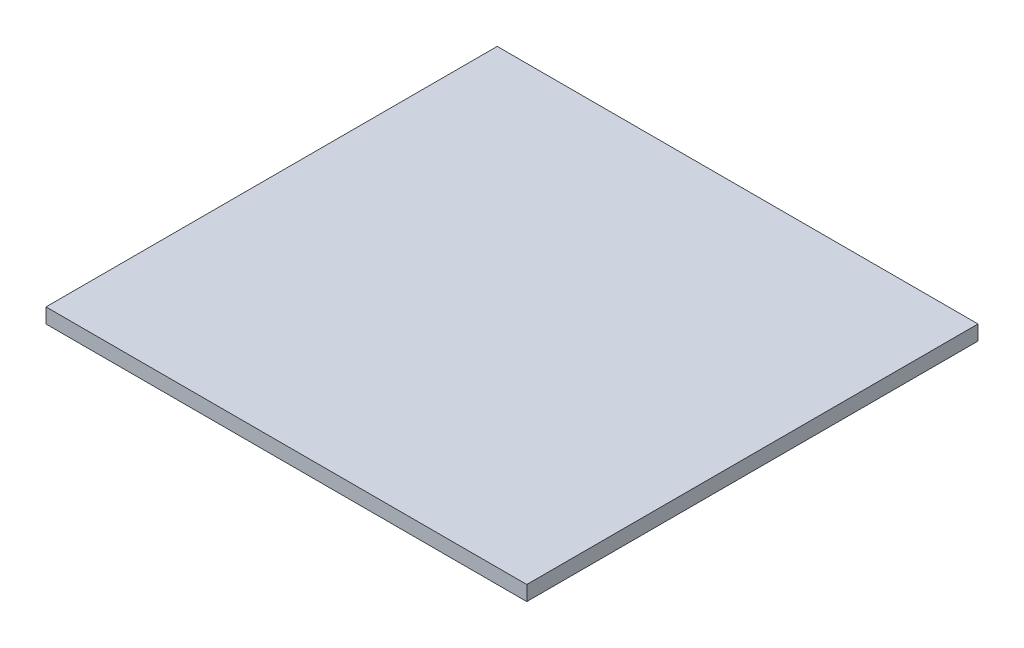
ISO-10303-21;
HEADER;
FILE_DESCRIPTION(('STEP AP214'),'2;1');
FILE_NAME('part.step','',(''),(''),'','','');
FILE_SCHEMA(('AUTOMOTIVE_DESIGN { 1 0 10303 214 1 1 1 1 }'));
ENDSEC;
DATA;
#1=APPLICATION_CONTEXT('core data for automotive mechanical design processes');
#2=APPLICATION_PROTOCOL_DEFINITION('international standard','automotive_design',2000,#1);
#3=PRODUCT_CONTEXT('',#1,'mechanical');
#4=PRODUCT('Part','Part','',(#3));
#5=PRODUCT_RELATED_PRODUCT_CATEGORY('part','',(#4));
#6=PRODUCT_DEFINITION_FORMATION('','',#4);
#7=PRODUCT_DEFINITION_CONTEXT('part definition',#1,'design');
#8=PRODUCT_DEFINITION('design','',#6,#7);
#9=PRODUCT_DEFINITION_SHAPE('','',#8);
#10=(LENGTH_UNIT() NAMED_UNIT(*) SI_UNIT(.MILLI.,.METRE.));
#11=(NAMED_UNIT(*) PLANE_ANGLE_UNIT() SI_UNIT($,.RADIAN.));
#12=(NAMED_UNIT(*) SI_UNIT($,.STERADIAN.) SOLID_ANGLE_UNIT());
#13=UNCERTAINTY_MEASURE_WITH_UNIT(LENGTH_MEASURE(1.E-05),#10,'distance_accuracy_value','');
#14=(GEOMETRIC_REPRESENTATION_CONTEXT(3) GLOBAL_UNCERTAINTY_ASSIGNED_CONTEXT((#13)) GLOBAL_UNIT_ASSIGNED_CONTEXT((#10,
#11,#12)) REPRESENTATION_CONTEXT('',''));
#15=CARTESIAN_POINT('',(0.,0.,0.));
#16=DIRECTION('',(0.,0.,1.));
#17=DIRECTION('',(1.,0.,0.));
#18=AXIS2_PLACEMENT_3D('',#15,#16,#17);
#19=CARTESIAN_POINT('',(14.4933099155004,2.5,-60.));
#20=DIRECTION('',(-1.,0.,0.));
#21=DIRECTION('',(0.,0.,1.));
#22=AXIS2_PLACEMENT_3D('',#19,#20,#21);
#23=PLANE('',#22);
#24=DIRECTION('',(0.,0.,-1.));
#25=VECTOR('',#24,1.);
#26=CARTESIAN_POINT('',(14.4933099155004,0.,-60.));
#27=LINE('',#26,#25);
#28=CARTESIAN_POINT('',(14.4933099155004,0.,16.020000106));
#29=VERTEX_POINT('',#28);
#30=CARTESIAN_POINT('',(14.4933099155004,0.,-60.));
#31=VERTEX_POINT('',#30);
#32=EDGE_CURVE('E96',#29,#31,#27,.T.);
#33=ORIENTED_EDGE('',*,*,#32,.T.);
#34=DIRECTION('',(0.,-1.,0.));
#35=VECTOR('',#34,1.);
#36=CARTESIAN_POINT('',(14.4933099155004,2.5,-60.));
#37=LINE('',#36,#35);
#38=CARTESIAN_POINT('',(14.4933099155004,2.5,-60.));
#39=VERTEX_POINT('',#38);
#40=EDGE_CURVE('E11',#39,#31,#37,.T.);
#41=ORIENTED_EDGE('',*,*,#40,.F.);
#42=DIRECTION('',(0.,0.,-1.));
#43=VECTOR('',#42,1.);
#44=CARTESIAN_POINT('',(14.4933099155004,2.5,-60.));
#45=LINE('',#44,#43);
#46=CARTESIAN_POINT('',(14.4933099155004,2.5,16.020000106));
#47=VERTEX_POINT('',#46);
#48=EDGE_CURVE('E84',#47,#39,#45,.T.);
#49=ORIENTED_EDGE('',*,*,#48,.F.);
#50=DIRECTION('',(0.,-1.,0.));
#51=VECTOR('',#50,1.);
#52=CARTESIAN_POINT('',(14.4933099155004,2.5,16.020000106));
#53=LINE('',#52,#51);
#54=EDGE_CURVE('E92',#47,#29,#53,.T.);
#55=ORIENTED_EDGE('',*,*,#54,.T.);
#56=EDGE_LOOP('',(#33,#41,#49,#55));
#57=FACE_BOUND('',#56,.T.);
#58=ADVANCED_FACE('F33',(#57),#23,.F.);
#59=CARTESIAN_POINT('',(-66.5066901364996,2.5,-60.));
#60=DIRECTION('',(0.,0.,1.));
#61=DIRECTION('',(1.,0.,0.));
#62=AXIS2_PLACEMENT_3D('',#59,#60,#61);
#63=PLANE('',#62);
#64=DIRECTION('',(-1.,0.,0.));
#65=VECTOR('',#64,1.);
#66=CARTESIAN_POINT('',(-66.5066901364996,0.,-60.));
#67=LINE('',#66,#65);
#68=CARTESIAN_POINT('',(-66.5066901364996,0.,-60.));
#69=VERTEX_POINT('',#68);
#70=EDGE_CURVE('E88',#31,#69,#67,.T.);
#71=ORIENTED_EDGE('',*,*,#70,.T.);
#72=DIRECTION('',(0.,-1.,0.));
#73=VECTOR('',#72,1.);
#74=CARTESIAN_POINT('',(-66.5066901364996,2.5,-60.));
#75=LINE('',#74,#73);
#76=CARTESIAN_POINT('',(-66.5066901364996,2.5,-60.));
#77=VERTEX_POINT('',#76);
#78=EDGE_CURVE('E41',#77,#69,#75,.T.);
#79=ORIENTED_EDGE('',*,*,#78,.F.);
#80=DIRECTION('',(-1.,0.,0.));
#81=VECTOR('',#80,1.);
#82=CARTESIAN_POINT('',(-66.5066901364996,2.5,-60.));
#83=LINE('',#82,#81);
#84=EDGE_CURVE('E79',#39,#77,#83,.T.);
#85=ORIENTED_EDGE('',*,*,#84,.F.);
#86=ORIENTED_EDGE('',*,*,#40,.T.);
#87=EDGE_LOOP('',(#71,#79,#85,#86));
#88=FACE_BOUND('',#87,.T.);
#89=ADVANCED_FACE('F87',(#88),#63,.F.);
#90=CARTESIAN_POINT('',(-66.5066901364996,2.5,-60.));
#91=DIRECTION('',(1.,0.,0.));
#92=DIRECTION('',(0.,0.,-1.));
#93=AXIS2_PLACEMENT_3D('',#90,#91,#92);
#94=PLANE('',#93);
#95=DIRECTION('',(0.,0.,1.));
#96=VECTOR('',#95,1.);
#97=CARTESIAN_POINT('',(-66.5066901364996,0.,-60.));
#98=LINE('',#97,#96);
#99=CARTESIAN_POINT('',(-66.5066901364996,0.,16.020000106));
#100=VERTEX_POINT('',#99);
#101=EDGE_CURVE('E66',#69,#100,#98,.T.);
#102=ORIENTED_EDGE('',*,*,#101,.T.);
#103=DIRECTION('',(0.,-1.,0.));
#104=VECTOR('',#103,1.);
#105=CARTESIAN_POINT('',(-66.5066901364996,2.5,16.020000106));
#106=LINE('',#105,#104);
#107=CARTESIAN_POINT('',(-66.5066901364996,2.5,16.020000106));
#108=VERTEX_POINT('',#107);
#109=EDGE_CURVE('E89',#108,#100,#106,.T.);
#110=ORIENTED_EDGE('',*,*,#109,.F.);
#111=DIRECTION('',(0.,0.,1.));
#112=VECTOR('',#111,1.);
#113=CARTESIAN_POINT('',(-66.5066901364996,2.5,-60.));
#114=LINE('',#113,#112);
#115=EDGE_CURVE('E82',#77,#108,#114,.T.);
#116=ORIENTED_EDGE('',*,*,#115,.F.);
#117=ORIENTED_EDGE('',*,*,#78,.T.);
#118=EDGE_LOOP('',(#102,#110,#116,#117));
#119=FACE_BOUND('',#118,.T.);
#120=ADVANCED_FACE('F90',(#119),#94,.F.);
#121=CARTESIAN_POINT('',(-66.5066901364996,2.5,16.020000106));
#122=DIRECTION('',(0.,0.,-1.));
#123=DIRECTION('',(-1.,0.,0.));
#124=AXIS2_PLACEMENT_3D('',#121,#122,#123);
#125=PLANE('',#124);
#126=DIRECTION('',(1.,0.,0.));
#127=VECTOR('',#126,1.);
#128=CARTESIAN_POINT('',(-66.5066901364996,0.,16.020000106));
#129=LINE('',#128,#127);
#130=EDGE_CURVE('E72',#100,#29,#129,.T.);
#131=ORIENTED_EDGE('',*,*,#130,.T.);
#132=ORIENTED_EDGE('',*,*,#54,.F.);
#133=DIRECTION('',(1.,0.,0.));
#134=VECTOR('',#133,1.);
#135=CARTESIAN_POINT('',(-66.5066901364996,2.5,16.020000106));
#136=LINE('',#135,#134);
#137=EDGE_CURVE('E49',#108,#47,#136,.T.);
#138=ORIENTED_EDGE('',*,*,#137,.F.);
#139=ORIENTED_EDGE('',*,*,#109,.T.);
#140=EDGE_LOOP('',(#131,#132,#138,#139));
#141=FACE_BOUND('',#140,.T.);
#142=ADVANCED_FACE('F103',(#141),#125,.F.);
#143=CARTESIAN_POINT('',(0.,2.5,0.));
#144=DIRECTION('',(0.,1.,0.));
#145=DIRECTION('',(0.,0.,1.));
#146=AXIS2_PLACEMENT_3D('',#143,#144,#145);
#147=PLANE('',#146);
#148=ORIENTED_EDGE('',*,*,#48,.T.);
#149=ORIENTED_EDGE('',*,*,#84,.T.);
#150=ORIENTED_EDGE('',*,*,#115,.T.);
#151=ORIENTED_EDGE('',*,*,#137,.T.);
#152=EDGE_LOOP('',(#148,#149,#150,#151));
#153=FACE_BOUND('',#152,.T.);
#154=ADVANCED_FACE('F80',(#153),#147,.T.);
#155=CARTESIAN_POINT('',(0.,0.,0.));
#156=DIRECTION('',(0.,1.,0.));
#157=DIRECTION('',(0.,0.,1.));
#158=AXIS2_PLACEMENT_3D('',#155,#156,#157);
#159=PLANE('',#158);
#160=ORIENTED_EDGE('',*,*,#32,.F.);
#161=ORIENTED_EDGE('',*,*,#130,.F.);
#162=ORIENTED_EDGE('',*,*,#101,.F.);
#163=ORIENTED_EDGE('',*,*,#70,.F.);
#164=EDGE_LOOP('',(#160,#161,#162,#163));
#165=FACE_BOUND('',#164,.T.);
#166=ADVANCED_FACE('F106',(#165),#159,.F.);
#167=CLOSED_SHELL('',(#58,#89,#120,#142,#154,#166));
#168=MANIFOLD_SOLID_BREP('B2',#167);
#169=ADVANCED_BREP_SHAPE_REPRESENTATION('',(#18,#168),#14);
#170=SHAPE_DEFINITION_REPRESENTATION(#9,#169);
ENDSEC;
END-ISO-10303-21;
